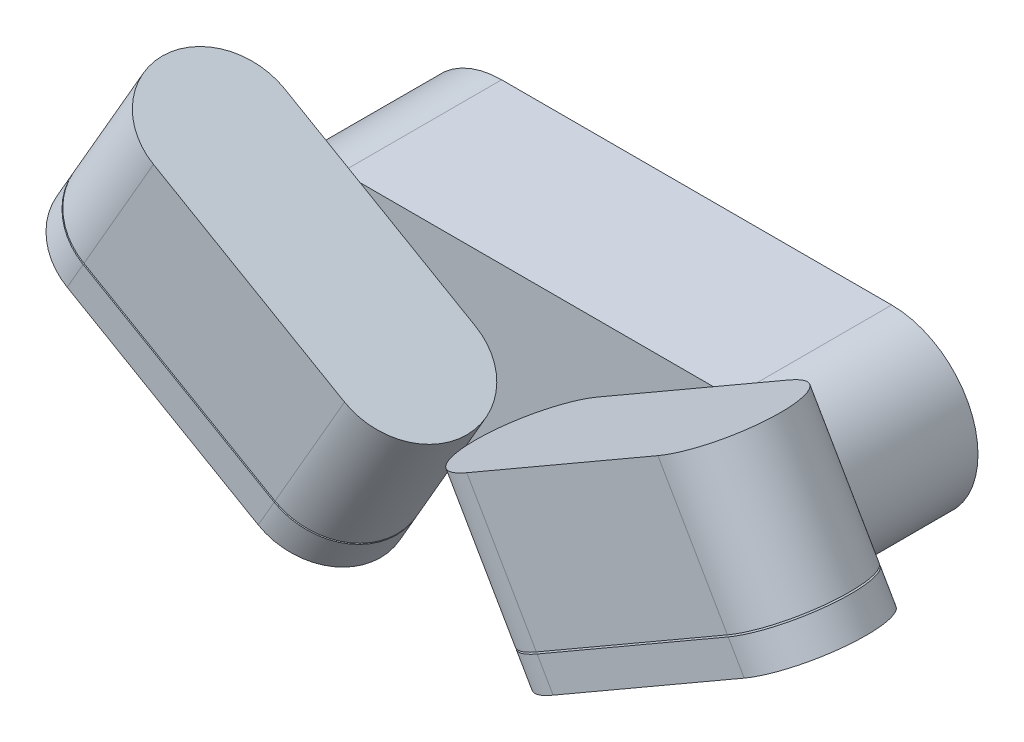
from build123d import *

# Parameters (mm, degrees)
SALIENTE_EXTRUIR1_DEPTH = 50
SALIENTE_EXTRUIR3_DEPTH = 41
CORTAR_EXTRUIR1_REACH   = 181.63
CORTAR_EXTRUIR2_DEPTH   = 0.5


with BuildPart() as part:
    # Croquis1 → Saliente-Extruir1 (new body)
    with BuildSketch(Plane.XY):
        with BuildLine():
            Line((-61, -27), (61, -27))
            ThreePointArc((61, -27), (88, 0), (61, 27))
            Line((61, 27), (-61, 27))
            ThreePointArc((-61, 27), (-88, 0), (-61, -27))
        make_face()
    extrude(amount=SALIENTE_EXTRUIR1_DEPTH)

    # Croquis2 → Saliente-Extruir3 (add)
    with BuildSketch(Plane.XY.offset(50)):
        with BuildLine():
            Line((-96.631397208, 50.882685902), (-123.631397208, 4.117314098))
            Line((-123.631397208, 4.117314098), (-28.368602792, -50.882685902))
            Line((-28.368602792, -50.882685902), (-14.579927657, -27))
            Line((-14.579927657, -27), (-61, -27))
            ThreePointArc((-61, -27), (-88, 0), (-61, 27))
            Line((-61, 27), (-55.265371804, 27))
            Line((-55.265371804, 27), (-96.631397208, 50.882685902))
        make_face()
        with BuildLine():
            Line((-1.368602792, -4.117314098), (-55.265371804, 27))
            Line((-55.265371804, 27), (-61, 27))
            ThreePointArc((-61, 27), (-88, 0), (-61, -27))
            Line((-61, -27), (-14.579927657, -27))
            Line((-14.579927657, -27), (-1.368602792, -4.117314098))
        make_face()
    saliente_extruir3 = extrude(amount=SALIENTE_EXTRUIR3_DEPTH)

    # Cortar-Extruir1: up to this face of the body (flat: up to its plane)
    cortar_extruir1_end = Plane(part.part.faces().sort_by_distance((-49, 23.382685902, 70.5))[0])
    # Croquis3 → Cortar-Extruir1 (cut, up to the picked face)
    with BuildSketch(Plane(origin=(-29.125, -50.44597977, 0), x_dir=(0.8660254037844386, -0.5000000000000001, 0), z_dir=(-0.5000000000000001, -0.8660254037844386, 0)), mode=Mode.PRIVATE) as cortar_extruir1_sk1:
        with BuildLine():
            ThreePointArc((-109.126587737, 70.5), (-103.122276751, 84.995689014), (-88.626587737, 91))
            Line((-88.626587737, 91), (-109.126587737, 91))
            Line((-109.126587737, 91), (-109.126587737, 70.5))
        make_face()
    cortar_extruir1_tool1 = split(extrude(cortar_extruir1_sk1.sketch, amount=-CORTAR_EXTRUIR1_REACH, mode=Mode.PRIVATE), bisect_by=cortar_extruir1_end, keep=Keep.BOTH, mode=Mode.PRIVATE)
    # Croquis3 → Cortar-Extruir1 (cut, up to the picked face)
    with BuildSketch(Plane(origin=(-29.125, -50.44597977, 0), x_dir=(0.8660254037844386, -0.5000000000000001, 0), z_dir=(-0.5000000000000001, -0.8660254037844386, 0)), mode=Mode.PRIVATE) as cortar_extruir1_sk2:
        with BuildLine():
            ThreePointArc((-88.626587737, 50), (-103.122276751, 56.004310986), (-109.126587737, 70.5))
            Line((-109.126587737, 70.5), (-109.126587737, 50))
            Line((-109.126587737, 50), (-88.626587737, 50))
        make_face()
    cortar_extruir1_tool2 = split(extrude(cortar_extruir1_sk2.sketch, amount=-CORTAR_EXTRUIR1_REACH, mode=Mode.PRIVATE), bisect_by=cortar_extruir1_end, keep=Keep.BOTH, mode=Mode.PRIVATE)
    # Croquis3 → Cortar-Extruir1 (cut, up to the picked face)
    with BuildSketch(Plane(origin=(-29.125, -50.44597977, 0), x_dir=(0.8660254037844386, -0.5000000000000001, 0), z_dir=(-0.5000000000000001, -0.8660254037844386, 0)), mode=Mode.PRIVATE) as cortar_extruir1_sk3:
        with BuildLine():
            Line((0.873412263, 91), (-19.626587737, 91))
            ThreePointArc((-19.626587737, 91), (-5.130898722, 84.995689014), (0.873412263, 70.5))
            Line((0.873412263, 70.5), (0.873412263, 91))
        make_face()
    cortar_extruir1_tool3 = split(extrude(cortar_extruir1_sk3.sketch, amount=-CORTAR_EXTRUIR1_REACH, mode=Mode.PRIVATE), bisect_by=cortar_extruir1_end, keep=Keep.BOTH, mode=Mode.PRIVATE)
    # Croquis3 → Cortar-Extruir1 (cut, up to the picked face)
    with BuildSketch(Plane(origin=(-29.125, -50.44597977, 0), x_dir=(0.8660254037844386, -0.5000000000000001, 0), z_dir=(-0.5000000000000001, -0.8660254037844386, 0)), mode=Mode.PRIVATE) as cortar_extruir1_sk4:
        with BuildLine():
            Line((0.873412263, 50), (0.873412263, 70.5))
            ThreePointArc((0.873412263, 70.5), (-5.130898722, 56.004310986), (-19.626587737, 50))
            Line((-19.626587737, 50), (0.873412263, 50))
        make_face()
    cortar_extruir1_tool4 = split(extrude(cortar_extruir1_sk4.sketch, amount=-CORTAR_EXTRUIR1_REACH, mode=Mode.PRIVATE), bisect_by=cortar_extruir1_end, keep=Keep.BOTH, mode=Mode.PRIVATE)
    cortar_extruir1_1 = cortar_extruir1_tool1.solids().sort_by(Axis((-119.66583, 1.827793, 86.420957), (0.5000000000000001, 0.8660254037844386, 0)))[0]
    add(cortar_extruir1_1, mode=Mode.SUBTRACT)
    cortar_extruir1_2 = cortar_extruir1_tool2.solids().sort_by(Axis((-119.66583, 1.827793, 54.579043), (0.5000000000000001, 0.8660254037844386, 0)))[0]
    add(cortar_extruir1_2, mode=Mode.SUBTRACT)
    cortar_extruir1_3 = cortar_extruir1_tool3.solids().sort_by(Axis((-32.33417, -48.593165, 86.420957), (0.5000000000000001, 0.8660254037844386, 0)))[0]
    add(cortar_extruir1_3, mode=Mode.SUBTRACT)
    cortar_extruir1_4 = cortar_extruir1_tool4.solids().sort_by(Axis((-32.33417, -48.593165, 54.579043), (0.5000000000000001, 0.8660254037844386, 0)))[0]
    add(cortar_extruir1_4, mode=Mode.SUBTRACT)
    cortar_extruir1 = cortar_extruir1_1 + cortar_extruir1_2 + cortar_extruir1_3 + cortar_extruir1_4  # Cortar-Extruir1 as one shape, for the pattern or mirror that repeats it

    # Croquis4 → Cortar-Extruir2 (cut)
    with BuildSketch(Plane(origin=(-24.125, -41.785725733, 0), x_dir=(-0.8660254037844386, 0.5000000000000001, 0), z_dir=(-0.5000000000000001, -0.8660254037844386, 0))):
        with BuildLine():
            Line((19.626587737, -91), (88.626587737, -91))
            ThreePointArc((88.626587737, -91), (109.126587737, -70.5), (88.626587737, -50))
            Line((88.626587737, -50), (19.626587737, -50))
            ThreePointArc((19.626587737, -50), (-0.873412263, -70.5), (19.626587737, -91))
        make_face()
        with BuildLine():
            Line((19.626587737, -86), (88.626587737, -86))
            ThreePointArc((88.626587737, -86), (104.126587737, -70.5), (88.626587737, -55))
            Line((88.626587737, -55), (19.626587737, -55))
            ThreePointArc((19.626587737, -55), (4.126587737, -70.5), (19.626587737, -86))
        make_face(mode=Mode.SUBTRACT)
    cortar_extruir2 = extrude(amount=-CORTAR_EXTRUIR2_DEPTH, mode=Mode.SUBTRACT)

    # Simetr_a3: Saliente-Extruir3, Cortar-Extruir1 across plane
    add(saliente_extruir3.mirror(Plane(origin=(0, 0, 0), x_dir=(0, 0, 1), z_dir=(1, 0, 0))))
    add(cortar_extruir1.mirror(Plane(origin=(0, 0, 0), x_dir=(0, 0, 1), z_dir=(1, 0, 0))), mode=Mode.SUBTRACT)

    # Simetr_a4: Cortar-Extruir2 across plane
    add(cortar_extruir2.mirror(Plane(origin=(0, 0, 0), x_dir=(0, 0, 1), z_dir=(1, 0, 0))), mode=Mode.SUBTRACT)


solid = part.part
